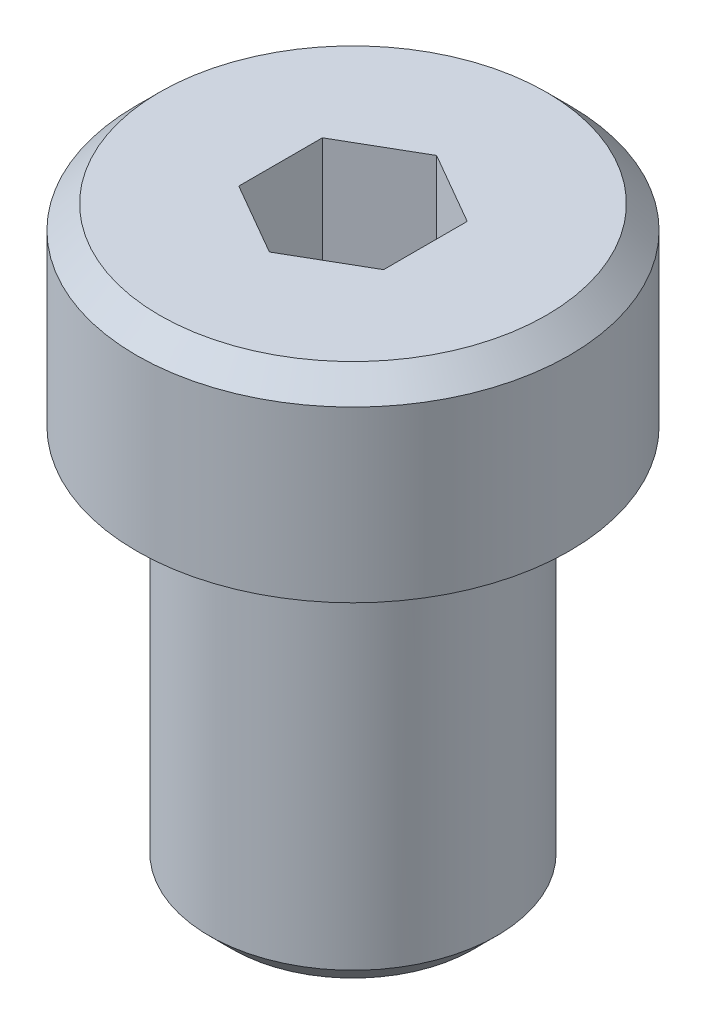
from build123d import *

# Parameters (mm, degrees)
SKETCH3_W          = 4.7371
SKETCH3_H          = 12.954
CUT_EXTRUDE1_DEPTH = 3.581396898
CHAMFER1_SIZE      = 0.762


with BuildPart() as part:
    # Sketch2 → Base-Revolve (revolve)
    with BuildSketch(Plane.XY):
        Polygon((0, 0), (7.137393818, 0), (7.137393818, 5.5879945), (6.375393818, 6.3499945), (0, 6.3499945), align=None)
    revolve(axis=Axis((0, 0, 0), (0, 1, 0)))

    # Sketch3 → Boss-Revolve1 (revolve)
    with BuildSketch(Plane.XY, mode=Mode.PRIVATE) as boss_revolve1_sk:
        with Locations((2.36855, -6.477)):
            Rectangle(SKETCH3_W, SKETCH3_H)
    revolve(boss_revolve1_sk.sketch.rotate(Axis((0, 0, 0), (0, 1, 0)), 90), axis=Axis((0, 0, 0), (0, 1, 0)))

    # Sketch4 → Cut-Extrude1 (cut)
    with BuildSketch(Plane(origin=(0, 6.3499945, 0), x_dir=(-1, 0, 0), z_dir=(0, 1, 0))):
        Polygon((2.387597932, 1.378480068), (6.25e-07, 2.756960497), (-2.387597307, 1.378481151), (-2.387598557, -1.378478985), (-1.876e-06, -2.756960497), (2.387596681, -1.378482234), align=None)
    extrude(amount=-CUT_EXTRUDE1_DEPTH, mode=Mode.SUBTRACT)

    # Chamfer1
    chamfer1_edges = [part.edges().sort_by_distance(p)[0] for p in [
        (0, -12.954, 4.7371),
    ]]
    chamfer(chamfer1_edges, length=CHAMFER1_SIZE)


solid = part.part
